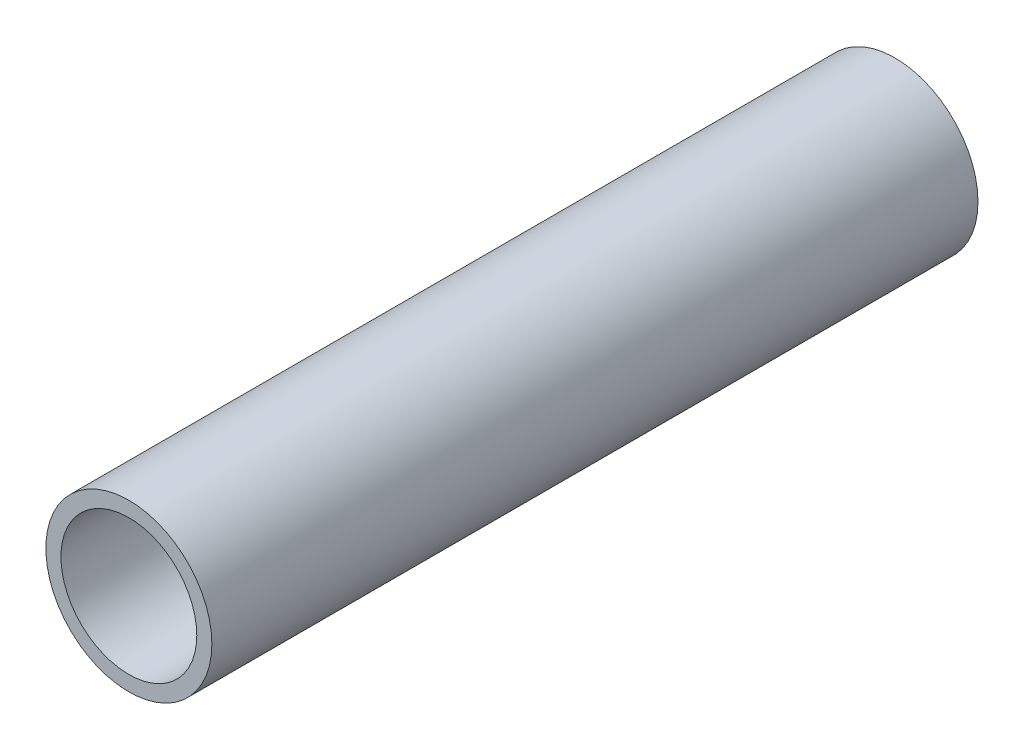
ISO-10303-21;
HEADER;
FILE_DESCRIPTION(('STEP AP214'),'2;1');
FILE_NAME('part.step','',(''),(''),'','','');
FILE_SCHEMA(('AUTOMOTIVE_DESIGN { 1 0 10303 214 1 1 1 1 }'));
ENDSEC;
DATA;
#1=APPLICATION_CONTEXT('core data for automotive mechanical design processes');
#2=APPLICATION_PROTOCOL_DEFINITION('international standard','automotive_design',2000,#1);
#3=PRODUCT_CONTEXT('',#1,'mechanical');
#4=PRODUCT('Part','Part','',(#3));
#5=PRODUCT_RELATED_PRODUCT_CATEGORY('part','',(#4));
#6=PRODUCT_DEFINITION_FORMATION('','',#4);
#7=PRODUCT_DEFINITION_CONTEXT('part definition',#1,'design');
#8=PRODUCT_DEFINITION('design','',#6,#7);
#9=PRODUCT_DEFINITION_SHAPE('','',#8);
#10=(LENGTH_UNIT() NAMED_UNIT(*) SI_UNIT(.MILLI.,.METRE.));
#11=(NAMED_UNIT(*) PLANE_ANGLE_UNIT() SI_UNIT($,.RADIAN.));
#12=(NAMED_UNIT(*) SI_UNIT($,.STERADIAN.) SOLID_ANGLE_UNIT());
#13=UNCERTAINTY_MEASURE_WITH_UNIT(LENGTH_MEASURE(1.E-05),#10,'distance_accuracy_value','');
#14=(GEOMETRIC_REPRESENTATION_CONTEXT(3) GLOBAL_UNCERTAINTY_ASSIGNED_CONTEXT((#13)) GLOBAL_UNIT_ASSIGNED_CONTEXT((#10,
#11,#12)) REPRESENTATION_CONTEXT('',''));
#15=CARTESIAN_POINT('',(0.,0.,0.));
#16=DIRECTION('',(0.,0.,1.));
#17=DIRECTION('',(1.,0.,0.));
#18=AXIS2_PLACEMENT_3D('',#15,#16,#17);
#19=CARTESIAN_POINT('',(0.,0.,40.29));
#20=DIRECTION('',(0.,0.,1.));
#21=DIRECTION('',(1.,0.,0.));
#22=AXIS2_PLACEMENT_3D('',#19,#20,#21);
#23=PLANE('',#22);
#24=CARTESIAN_POINT('',(0.,0.,40.29));
#25=DIRECTION('',(0.,0.,1.));
#26=DIRECTION('',(1.,0.,0.));
#27=AXIS2_PLACEMENT_3D('',#24,#25,#26);
#28=CIRCLE('',#27,8.73125);
#29=CARTESIAN_POINT('',(8.73125,0.,40.29));
#30=VERTEX_POINT('',#29);
#31=EDGE_CURVE('E10',#30,#30,#28,.T.);
#32=ORIENTED_EDGE('',*,*,#31,.T.);
#33=EDGE_LOOP('',(#32));
#34=FACE_BOUND('',#33,.T.);
#35=CARTESIAN_POINT('',(0.,0.,40.29));
#36=DIRECTION('',(0.,0.,1.));
#37=DIRECTION('',(1.,0.,0.));
#38=AXIS2_PLACEMENT_3D('',#35,#36,#37);
#39=CIRCLE('',#38,7.14375);
#40=CARTESIAN_POINT('',(7.14375,0.,40.29));
#41=VERTEX_POINT('',#40);
#42=EDGE_CURVE('E39',#41,#41,#39,.T.);
#43=ORIENTED_EDGE('',*,*,#42,.F.);
#44=EDGE_LOOP('',(#43));
#45=FACE_BOUND('',#44,.T.);
#46=ADVANCED_FACE('F28',(#34,#45),#23,.T.);
#47=CARTESIAN_POINT('',(0.,0.,-40.29));
#48=DIRECTION('',(0.,0.,1.));
#49=DIRECTION('',(1.,0.,0.));
#50=AXIS2_PLACEMENT_3D('',#47,#48,#49);
#51=PLANE('',#50);
#52=CARTESIAN_POINT('',(0.,0.,-40.29));
#53=DIRECTION('',(0.,0.,1.));
#54=DIRECTION('',(1.,0.,0.));
#55=AXIS2_PLACEMENT_3D('',#52,#53,#54);
#56=CIRCLE('',#55,8.73125);
#57=CARTESIAN_POINT('',(8.73125,0.,-40.29));
#58=VERTEX_POINT('',#57);
#59=EDGE_CURVE('E32',#58,#58,#56,.T.);
#60=ORIENTED_EDGE('',*,*,#59,.F.);
#61=EDGE_LOOP('',(#60));
#62=FACE_BOUND('',#61,.T.);
#63=CARTESIAN_POINT('',(0.,0.,-40.29));
#64=DIRECTION('',(0.,0.,1.));
#65=DIRECTION('',(1.,0.,0.));
#66=AXIS2_PLACEMENT_3D('',#63,#64,#65);
#67=CIRCLE('',#66,7.14375);
#68=CARTESIAN_POINT('',(7.14375,0.,-40.29));
#69=VERTEX_POINT('',#68);
#70=EDGE_CURVE('E41',#69,#69,#67,.T.);
#71=ORIENTED_EDGE('',*,*,#70,.T.);
#72=EDGE_LOOP('',(#71));
#73=FACE_BOUND('',#72,.T.);
#74=ADVANCED_FACE('F51',(#62,#73),#51,.F.);
#75=CARTESIAN_POINT('',(0.,0.,40.29));
#76=DIRECTION('',(0.,0.,-1.));
#77=DIRECTION('',(-1.,0.,0.));
#78=AXIS2_PLACEMENT_3D('',#75,#76,#77);
#79=CYLINDRICAL_SURFACE('',#78,8.73125);
#80=ORIENTED_EDGE('',*,*,#31,.F.);
#81=EDGE_LOOP('',(#80));
#82=FACE_BOUND('',#81,.T.);
#83=ORIENTED_EDGE('',*,*,#59,.T.);
#84=EDGE_LOOP('',(#83));
#85=FACE_BOUND('',#84,.T.);
#86=ADVANCED_FACE('F30',(#82,#85),#79,.T.);
#87=CARTESIAN_POINT('',(0.,0.,40.29));
#88=DIRECTION('',(0.,0.,-1.));
#89=DIRECTION('',(-1.,0.,0.));
#90=AXIS2_PLACEMENT_3D('',#87,#88,#89);
#91=CYLINDRICAL_SURFACE('',#90,7.14375);
#92=ORIENTED_EDGE('',*,*,#42,.T.);
#93=EDGE_LOOP('',(#92));
#94=FACE_BOUND('',#93,.T.);
#95=ORIENTED_EDGE('',*,*,#70,.F.);
#96=EDGE_LOOP('',(#95));
#97=FACE_BOUND('',#96,.T.);
#98=ADVANCED_FACE('F47',(#94,#97),#91,.F.);
#99=CLOSED_SHELL('',(#46,#74,#86,#98));
#100=MANIFOLD_SOLID_BREP('B2',#99);
#101=ADVANCED_BREP_SHAPE_REPRESENTATION('',(#18,#100),#14);
#102=SHAPE_DEFINITION_REPRESENTATION(#9,#101);
ENDSEC;
END-ISO-10303-21;
